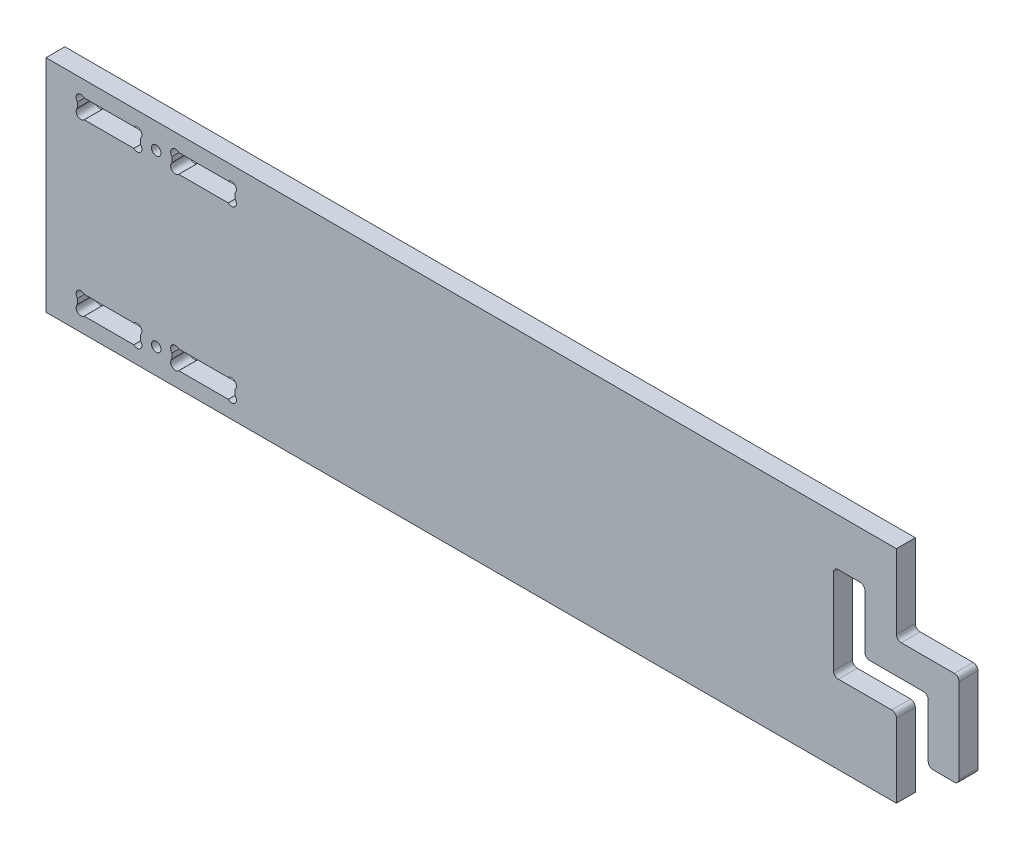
from build123d import *

# Parameters (mm, degrees)
ESQUISSE1_R      = 1.5
EXTRUSION1_DEPTH = 6


with BuildPart() as part:
    # Esquisse1 → Extrusion1 (new body)
    with BuildSketch(Plane.XY):
        with BuildLine():
            Line((270, 70), (270, 46.43))
            ThreePointArc((270, 46.43), (270.448126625, 45.348126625), (271.53, 44.9))
            Line((271.53, 44.9), (288.39, 44.9))
            ThreePointArc((288.39, 44.9), (289.45773124, 44.45773124), (289.9, 43.39))
            Line((289.9, 43.39), (289.9, 16.51))
            ThreePointArc((289.9, 16.51), (289.45773124, 15.44226876), (288.39, 15))
            Line((288.39, 15), (281.61, 15))
            ThreePointArc((281.61, 15), (280.54226876, 15.44226876), (280.1, 16.51))
            Line((280.1, 16.51), (280.1, 33.47))
            ThreePointArc((280.1, 33.47), (279.651873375, 34.551873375), (278.57, 35))
            Line((278.57, 35), (261.51, 35))
            ThreePointArc((261.51, 35), (260.44226876, 35.44226876), (260, 36.51))
            Line((260, 36.51), (260, 53.47))
            ThreePointArc((260, 53.47), (259.551873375, 54.551873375), (258.47, 55))
            Line((258.47, 55), (251.53, 55))
            ThreePointArc((251.53, 55), (250.448126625, 54.551873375), (250, 53.47))
            Line((250, 53.47), (250, 26.43))
            ThreePointArc((250, 26.43), (250.448126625, 25.348126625), (251.53, 24.9))
            Line((251.53, 24.9), (268.49, 24.9))
            ThreePointArc((268.49, 24.9), (269.55773124, 24.45773124), (270, 23.39))
            Line((270, 23.39), (270, 0))
            Line((270, 0), (0, 0))
            Line((0, 0), (0, 70))
            Line((0, 70), (270, 70))
        make_face()
        with Locations((35, 8)):
            Circle(ESQUISSE1_R, mode=Mode.SUBTRACT)
        with Locations(Location((35, 62, 0), (0, 0, 180))):
            Circle(ESQUISSE1_R, mode=Mode.SUBTRACT)
        with BuildLine():
            Line((57.850395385, 11), (42.149604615, 11))
            ThreePointArc((42.149604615, 11), (40, 11), (40, 8.850395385))
            Line((40, 8.850395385), (40, 7.149604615))
            ThreePointArc((40, 7.149604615), (40, 5), (42.149604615, 5))
            Line((42.149604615, 5), (57.850395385, 5))
            ThreePointArc((57.850395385, 5), (60, 5), (60, 7.149604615))
            Line((60, 7.149604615), (60, 8.850395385))
            ThreePointArc((60, 8.850395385), (60, 11), (57.850395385, 11))
        make_face(mode=Mode.SUBTRACT)
        with BuildLine():
            Line((12.149604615, 11), (27.850395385, 11))
            ThreePointArc((27.850395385, 11), (30, 11), (30, 8.850395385))
            Line((30, 8.850395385), (30, 7.149604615))
            ThreePointArc((30, 7.149604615), (30, 5), (27.850395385, 5))
            Line((27.850395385, 5), (12.149604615, 5))
            ThreePointArc((12.149604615, 5), (10, 5), (10, 7.149604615))
            Line((10, 7.149604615), (10, 8.850395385))
            ThreePointArc((10, 8.850395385), (10, 11), (12.149604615, 11))
        make_face(mode=Mode.SUBTRACT)
        with BuildLine():
            Line((60, 61.149604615), (60, 62.850395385))
            ThreePointArc((60, 62.850395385), (60, 65), (57.850395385, 65))
            Line((57.850395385, 65), (42.149604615, 65))
            ThreePointArc((42.149604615, 65), (40, 65), (40, 62.850395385))
            Line((40, 62.850395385), (40, 61.149604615))
            ThreePointArc((40, 61.149604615), (40, 59), (42.149604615, 59))
            Line((42.149604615, 59), (57.850395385, 59))
            ThreePointArc((57.850395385, 59), (60, 59), (60, 61.149604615))
        make_face(mode=Mode.SUBTRACT)
        with BuildLine():
            Line((30, 61.149604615), (30, 62.850395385))
            ThreePointArc((30, 62.850395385), (30, 65), (27.850395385, 65))
            Line((27.850395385, 65), (12.149604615, 65))
            ThreePointArc((12.149604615, 65), (10, 65), (10, 62.850395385))
            Line((10, 62.850395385), (10, 61.149604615))
            ThreePointArc((10, 61.149604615), (10, 59), (12.149604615, 59))
            Line((12.149604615, 59), (27.850395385, 59))
            ThreePointArc((27.850395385, 59), (30, 59), (30, 61.149604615))
        make_face(mode=Mode.SUBTRACT)
    extrude(amount=EXTRUSION1_DEPTH)


solid = part.part
